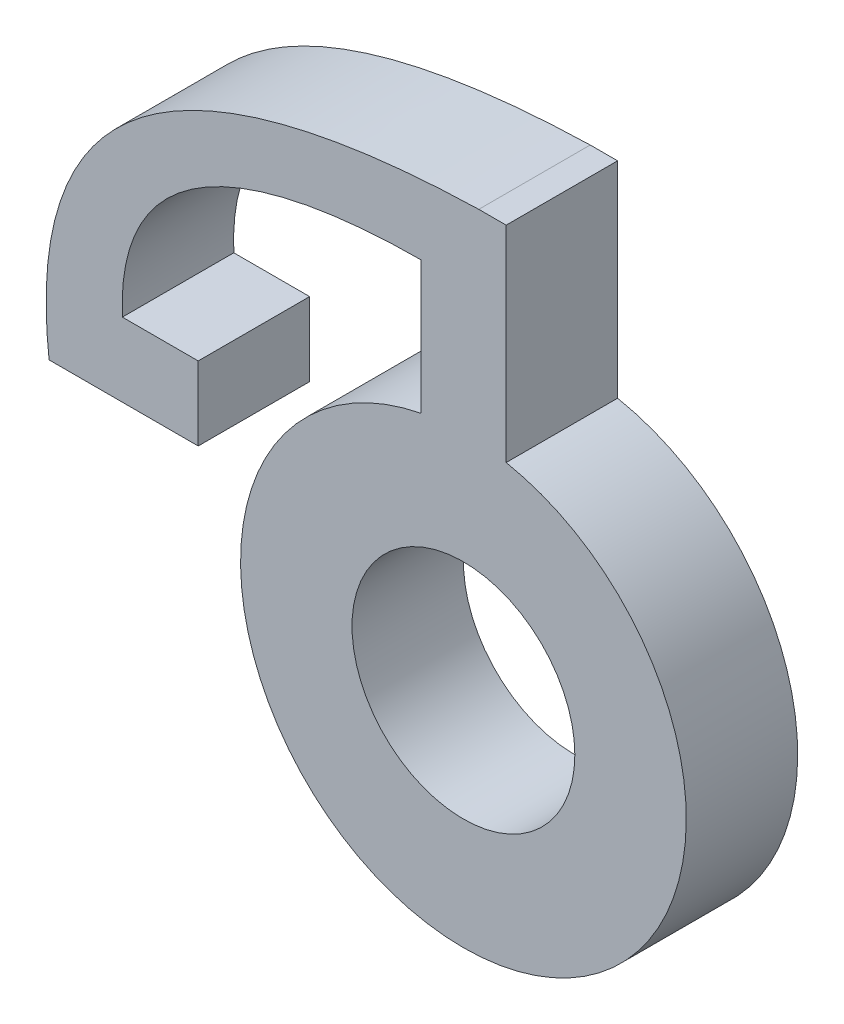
ISO-10303-21;
HEADER;
FILE_DESCRIPTION(('STEP AP214'),'2;1');
FILE_NAME('part.step','',(''),(''),'','','');
FILE_SCHEMA(('AUTOMOTIVE_DESIGN { 1 0 10303 214 1 1 1 1 }'));
ENDSEC;
DATA;
#1=APPLICATION_CONTEXT('core data for automotive mechanical design processes');
#2=APPLICATION_PROTOCOL_DEFINITION('international standard','automotive_design',2000,#1);
#3=PRODUCT_CONTEXT('',#1,'mechanical');
#4=PRODUCT('Part','Part','',(#3));
#5=PRODUCT_RELATED_PRODUCT_CATEGORY('part','',(#4));
#6=PRODUCT_DEFINITION_FORMATION('','',#4);
#7=PRODUCT_DEFINITION_CONTEXT('part definition',#1,'design');
#8=PRODUCT_DEFINITION('design','',#6,#7);
#9=PRODUCT_DEFINITION_SHAPE('','',#8);
#10=(LENGTH_UNIT() NAMED_UNIT(*) SI_UNIT(.MILLI.,.METRE.));
#11=(NAMED_UNIT(*) PLANE_ANGLE_UNIT() SI_UNIT($,.RADIAN.));
#12=(NAMED_UNIT(*) SI_UNIT($,.STERADIAN.) SOLID_ANGLE_UNIT());
#13=UNCERTAINTY_MEASURE_WITH_UNIT(LENGTH_MEASURE(1.E-05),#10,'distance_accuracy_value','');
#14=(GEOMETRIC_REPRESENTATION_CONTEXT(3) GLOBAL_UNCERTAINTY_ASSIGNED_CONTEXT((#13)) GLOBAL_UNIT_ASSIGNED_CONTEXT((#10,
#11,#12)) REPRESENTATION_CONTEXT('',''));
#15=CARTESIAN_POINT('',(0.,0.,0.));
#16=DIRECTION('',(0.,0.,1.));
#17=DIRECTION('',(1.,0.,0.));
#18=AXIS2_PLACEMENT_3D('',#15,#16,#17);
#19=CARTESIAN_POINT('',(0.,0.,3.175));
#20=DIRECTION('',(0.,0.,1.));
#21=DIRECTION('',(1.,0.,0.));
#22=AXIS2_PLACEMENT_3D('',#19,#20,#21);
#23=PLANE('',#22);
#24=CARTESIAN_POINT('',(0.,0.,3.175));
#25=DIRECTION('',(0.,0.,1.));
#26=DIRECTION('',(1.,0.,0.));
#27=AXIS2_PLACEMENT_3D('',#24,#25,#26);
#28=CIRCLE('',#27,6.35);
#29=CARTESIAN_POINT('',(-1.21254471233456,6.23315612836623,3.175));
#30=VERTEX_POINT('',#29);
#31=CARTESIAN_POINT('',(1.21809473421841,6.23207390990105,3.175));
#32=VERTEX_POINT('',#31);
#33=EDGE_CURVE('E228',#30,#32,#28,.T.);
#34=ORIENTED_EDGE('',*,*,#33,.T.);
#35=DIRECTION('',(0.,1.,0.));
#36=VECTOR('',#35,1.);
#37=CARTESIAN_POINT('',(1.21809473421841,12.0905218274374,3.175));
#38=LINE('',#37,#36);
#39=CARTESIAN_POINT('',(1.21809473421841,12.0905218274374,3.175));
#40=VERTEX_POINT('',#39);
#41=EDGE_CURVE('E96',#32,#40,#38,.T.);
#42=ORIENTED_EDGE('',*,*,#41,.T.);
#43=DIRECTION('',(-1.,0.,0.));
#44=VECTOR('',#43,1.);
#45=CARTESIAN_POINT('',(0.437924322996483,12.0905218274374,3.175));
#46=LINE('',#45,#44);
#47=CARTESIAN_POINT('',(0.437924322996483,12.0905218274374,3.175));
#48=VERTEX_POINT('',#47);
#49=EDGE_CURVE('E171',#40,#48,#46,.T.);
#50=ORIENTED_EDGE('',*,*,#49,.T.);
#51=CARTESIAN_POINT('',(0.437924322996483,12.0905218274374,3.175));
#52=CARTESIAN_POINT('',(-12.9098002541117,11.7386809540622,3.175));
#53=CARTESIAN_POINT('',(-11.8053695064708,2.25252211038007,3.175));
#54=B_SPLINE_CURVE_WITH_KNOTS('',2,(#51,#52,#53),.UNSPECIFIED.,.F.,.F.,(3,3),(0.,1.),.UNSPECIFIED.);
#55=CARTESIAN_POINT('',(-11.8053695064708,2.25252211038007,3.175));
#56=VERTEX_POINT('',#55);
#57=EDGE_CURVE('E164',#48,#56,#54,.T.);
#58=ORIENTED_EDGE('',*,*,#57,.T.);
#59=DIRECTION('',(1.,0.,0.));
#60=VECTOR('',#59,1.);
#61=CARTESIAN_POINT('',(-11.8053695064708,2.25252211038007,3.175));
#62=LINE('',#61,#60);
#63=CARTESIAN_POINT('',(-7.55702562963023,2.25252211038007,3.175));
#64=VERTEX_POINT('',#63);
#65=EDGE_CURVE('E170',#56,#64,#62,.T.);
#66=ORIENTED_EDGE('',*,*,#65,.T.);
#67=DIRECTION('',(0.,1.,0.));
#68=VECTOR('',#67,1.);
#69=CARTESIAN_POINT('',(-7.55702562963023,2.25252211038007,3.175));
#70=LINE('',#69,#68);
#71=CARTESIAN_POINT('',(-7.55702562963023,4.35238384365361,3.175));
#72=VERTEX_POINT('',#71);
#73=EDGE_CURVE('E118',#64,#72,#70,.T.);
#74=ORIENTED_EDGE('',*,*,#73,.T.);
#75=DIRECTION('',(-1.,0.,0.));
#76=VECTOR('',#75,1.);
#77=CARTESIAN_POINT('',(-7.55702562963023,4.35238384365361,3.175));
#78=LINE('',#77,#76);
#79=CARTESIAN_POINT('',(-9.71832555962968,4.35238384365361,3.175));
#80=VERTEX_POINT('',#79);
#81=EDGE_CURVE('E112',#72,#80,#78,.T.);
#82=ORIENTED_EDGE('',*,*,#81,.T.);
#83=CARTESIAN_POINT('',(-9.71832555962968,4.35238384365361,3.175));
#84=CARTESIAN_POINT('',(-9.92744832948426,9.2319151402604,3.175));
#85=CARTESIAN_POINT('',(-4.66054864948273,10.0073590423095,3.175));
#86=CARTESIAN_POINT('',(-1.21254471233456,10.0204833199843,3.175));
#87=B_SPLINE_CURVE_WITH_KNOTS('',3,(#83,#84,#85,#86),.UNSPECIFIED.,.F.,.F.,(4,4),(0.,
0.593316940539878),.UNSPECIFIED.);
#88=CARTESIAN_POINT('',(-1.21254471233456,10.0204833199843,3.175));
#89=VERTEX_POINT('',#88);
#90=EDGE_CURVE('E116',#80,#89,#87,.T.);
#91=ORIENTED_EDGE('',*,*,#90,.T.);
#92=DIRECTION('',(0.,-1.,0.));
#93=VECTOR('',#92,1.);
#94=CARTESIAN_POINT('',(-1.21254471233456,10.0204833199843,3.175));
#95=LINE('',#94,#93);
#96=EDGE_CURVE('E50',#89,#30,#95,.T.);
#97=ORIENTED_EDGE('',*,*,#96,.T.);
#98=EDGE_LOOP('',(#34,#42,#50,#58,#66,#74,#82,#91,#97));
#99=FACE_BOUND('',#98,.T.);
#100=CARTESIAN_POINT('',(0.,0.,3.175));
#101=DIRECTION('',(0.,0.,1.));
#102=DIRECTION('',(1.,0.,0.));
#103=AXIS2_PLACEMENT_3D('',#100,#101,#102);
#104=CIRCLE('',#103,3.175);
#105=CARTESIAN_POINT('',(3.175,0.,3.175));
#106=VERTEX_POINT('',#105);
#107=EDGE_CURVE('E232',#106,#106,#104,.T.);
#108=ORIENTED_EDGE('',*,*,#107,.F.);
#109=EDGE_LOOP('',(#108));
#110=FACE_BOUND('',#109,.T.);
#111=ADVANCED_FACE('F33',(#99,#110),#23,.T.);
#112=CARTESIAN_POINT('',(0.,0.,0.));
#113=DIRECTION('',(0.,0.,1.));
#114=DIRECTION('',(1.,0.,0.));
#115=AXIS2_PLACEMENT_3D('',#112,#113,#114);
#116=PLANE('',#115);
#117=CARTESIAN_POINT('',(0.,0.,0.));
#118=DIRECTION('',(0.,0.,1.));
#119=DIRECTION('',(1.,0.,0.));
#120=AXIS2_PLACEMENT_3D('',#117,#118,#119);
#121=CIRCLE('',#120,6.35);
#122=CARTESIAN_POINT('',(-1.21254471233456,6.23315612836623,0.));
#123=VERTEX_POINT('',#122);
#124=CARTESIAN_POINT('',(1.21809473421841,6.23207390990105,0.));
#125=VERTEX_POINT('',#124);
#126=EDGE_CURVE('E210',#123,#125,#121,.T.);
#127=ORIENTED_EDGE('',*,*,#126,.F.);
#128=DIRECTION('',(0.,-1.,0.));
#129=VECTOR('',#128,1.);
#130=CARTESIAN_POINT('',(-1.21254471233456,10.0204833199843,0.));
#131=LINE('',#130,#129);
#132=CARTESIAN_POINT('',(-1.21254471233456,10.0204833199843,0.));
#133=VERTEX_POINT('',#132);
#134=EDGE_CURVE('E88',#133,#123,#131,.T.);
#135=ORIENTED_EDGE('',*,*,#134,.F.);
#136=CARTESIAN_POINT('',(-9.71832555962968,4.35238384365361,0.));
#137=CARTESIAN_POINT('',(-9.92744832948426,9.2319151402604,0.));
#138=CARTESIAN_POINT('',(-4.66054864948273,10.0073590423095,0.));
#139=CARTESIAN_POINT('',(-1.21254471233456,10.0204833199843,0.));
#140=B_SPLINE_CURVE_WITH_KNOTS('',3,(#136,#137,#138,#139),.UNSPECIFIED.,.F.,.F.,(4,4),(0.,
0.593316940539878),.UNSPECIFIED.);
#141=CARTESIAN_POINT('',(-9.71832555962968,4.35238384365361,0.));
#142=VERTEX_POINT('',#141);
#143=EDGE_CURVE('E82',#142,#133,#140,.T.);
#144=ORIENTED_EDGE('',*,*,#143,.F.);
#145=DIRECTION('',(-1.,0.,0.));
#146=VECTOR('',#145,1.);
#147=CARTESIAN_POINT('',(-7.55702562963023,4.35238384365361,0.));
#148=LINE('',#147,#146);
#149=CARTESIAN_POINT('',(-7.55702562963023,4.35238384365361,0.));
#150=VERTEX_POINT('',#149);
#151=EDGE_CURVE('E126',#150,#142,#148,.T.);
#152=ORIENTED_EDGE('',*,*,#151,.F.);
#153=DIRECTION('',(0.,1.,0.));
#154=VECTOR('',#153,1.);
#155=CARTESIAN_POINT('',(-7.55702562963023,2.25252211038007,0.));
#156=LINE('',#155,#154);
#157=CARTESIAN_POINT('',(-7.55702562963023,2.25252211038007,0.));
#158=VERTEX_POINT('',#157);
#159=EDGE_CURVE('E188',#158,#150,#156,.T.);
#160=ORIENTED_EDGE('',*,*,#159,.F.);
#161=DIRECTION('',(1.,0.,0.));
#162=VECTOR('',#161,1.);
#163=CARTESIAN_POINT('',(-11.8053695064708,2.25252211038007,0.));
#164=LINE('',#163,#162);
#165=CARTESIAN_POINT('',(-11.8053695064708,2.25252211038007,0.));
#166=VERTEX_POINT('',#165);
#167=EDGE_CURVE('E184',#166,#158,#164,.T.);
#168=ORIENTED_EDGE('',*,*,#167,.F.);
#169=CARTESIAN_POINT('',(0.437924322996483,12.0905218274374,0.));
#170=CARTESIAN_POINT('',(-12.9098002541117,11.7386809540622,0.));
#171=CARTESIAN_POINT('',(-11.8053695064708,2.25252211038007,0.));
#172=B_SPLINE_CURVE_WITH_KNOTS('',2,(#169,#170,#171),.UNSPECIFIED.,.F.,.F.,(3,3),(0.,1.),.UNSPECIFIED.);
#173=CARTESIAN_POINT('',(0.437924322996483,12.0905218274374,0.));
#174=VERTEX_POINT('',#173);
#175=EDGE_CURVE('E207',#174,#166,#172,.T.);
#176=ORIENTED_EDGE('',*,*,#175,.F.);
#177=DIRECTION('',(-1.,0.,0.));
#178=VECTOR('',#177,1.);
#179=CARTESIAN_POINT('',(0.437924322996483,12.0905218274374,0.));
#180=LINE('',#179,#178);
#181=CARTESIAN_POINT('',(1.21809473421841,12.0905218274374,0.));
#182=VERTEX_POINT('',#181);
#183=EDGE_CURVE('E200',#182,#174,#180,.T.);
#184=ORIENTED_EDGE('',*,*,#183,.F.);
#185=DIRECTION('',(0.,1.,0.));
#186=VECTOR('',#185,1.);
#187=CARTESIAN_POINT('',(1.21809473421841,12.0905218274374,0.));
#188=LINE('',#187,#186);
#189=EDGE_CURVE('E206',#125,#182,#188,.T.);
#190=ORIENTED_EDGE('',*,*,#189,.F.);
#191=EDGE_LOOP('',(#127,#135,#144,#152,#160,#168,#176,#184,#190));
#192=FACE_BOUND('',#191,.T.);
#193=CARTESIAN_POINT('',(0.,0.,0.));
#194=DIRECTION('',(0.,0.,1.));
#195=DIRECTION('',(1.,0.,0.));
#196=AXIS2_PLACEMENT_3D('',#193,#194,#195);
#197=CIRCLE('',#196,3.175);
#198=CARTESIAN_POINT('',(3.175,0.,0.));
#199=VERTEX_POINT('',#198);
#200=EDGE_CURVE('E234',#199,#199,#197,.T.);
#201=ORIENTED_EDGE('',*,*,#200,.T.);
#202=EDGE_LOOP('',(#201));
#203=FACE_BOUND('',#202,.T.);
#204=ADVANCED_FACE('F204',(#192,#203),#116,.F.);
#205=CARTESIAN_POINT('',(0.,0.,3.175));
#206=DIRECTION('',(0.,0.,-1.));
#207=DIRECTION('',(-1.,0.,0.));
#208=AXIS2_PLACEMENT_3D('',#205,#206,#207);
#209=CYLINDRICAL_SURFACE('',#208,6.35);
#210=ORIENTED_EDGE('',*,*,#126,.T.);
#211=DIRECTION('',(0.,0.,-1.));
#212=VECTOR('',#211,1.);
#213=CARTESIAN_POINT('',(1.21809473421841,6.23207390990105,3.175));
#214=LINE('',#213,#212);
#215=EDGE_CURVE('E11',#32,#125,#214,.T.);
#216=ORIENTED_EDGE('',*,*,#215,.F.);
#217=ORIENTED_EDGE('',*,*,#33,.F.);
#218=DIRECTION('',(0.,0.,-1.));
#219=VECTOR('',#218,1.);
#220=CARTESIAN_POINT('',(-1.21254471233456,6.23315612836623,3.175));
#221=LINE('',#220,#219);
#222=EDGE_CURVE('E132',#30,#123,#221,.T.);
#223=ORIENTED_EDGE('',*,*,#222,.T.);
#224=EDGE_LOOP('',(#210,#216,#217,#223));
#225=FACE_BOUND('',#224,.T.);
#226=ADVANCED_FACE('F35',(#225),#209,.T.);
#227=CARTESIAN_POINT('',(1.21809473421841,12.0905218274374,3.175));
#228=DIRECTION('',(-1.,0.,0.));
#229=DIRECTION('',(0.,-1.,0.));
#230=AXIS2_PLACEMENT_3D('',#227,#228,#229);
#231=PLANE('',#230);
#232=ORIENTED_EDGE('',*,*,#189,.T.);
#233=DIRECTION('',(0.,0.,-1.));
#234=VECTOR('',#233,1.);
#235=CARTESIAN_POINT('',(1.21809473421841,12.0905218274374,3.175));
#236=LINE('',#235,#234);
#237=EDGE_CURVE('E42',#40,#182,#236,.T.);
#238=ORIENTED_EDGE('',*,*,#237,.F.);
#239=ORIENTED_EDGE('',*,*,#41,.F.);
#240=ORIENTED_EDGE('',*,*,#215,.T.);
#241=EDGE_LOOP('',(#232,#238,#239,#240));
#242=FACE_BOUND('',#241,.T.);
#243=ADVANCED_FACE('F242',(#242),#231,.F.);
#244=CARTESIAN_POINT('',(0.437924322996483,12.0905218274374,3.175));
#245=DIRECTION('',(0.,-1.,0.));
#246=DIRECTION('',(0.,0.,-1.));
#247=AXIS2_PLACEMENT_3D('',#244,#245,#246);
#248=PLANE('',#247);
#249=ORIENTED_EDGE('',*,*,#183,.T.);
#250=DIRECTION('',(0.,0.,-1.));
#251=VECTOR('',#250,1.);
#252=CARTESIAN_POINT('',(0.437924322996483,12.0905218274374,3.175));
#253=LINE('',#252,#251);
#254=EDGE_CURVE('E193',#48,#174,#253,.T.);
#255=ORIENTED_EDGE('',*,*,#254,.F.);
#256=ORIENTED_EDGE('',*,*,#49,.F.);
#257=ORIENTED_EDGE('',*,*,#237,.T.);
#258=EDGE_LOOP('',(#249,#255,#256,#257));
#259=FACE_BOUND('',#258,.T.);
#260=ADVANCED_FACE('F162',(#259),#248,.F.);
#261=DIRECTION('',(0.,0.,-1.));
#262=VECTOR('',#261,1.);
#263=SURFACE_OF_LINEAR_EXTRUSION('',#54,#262);
#264=ORIENTED_EDGE('',*,*,#175,.T.);
#265=DIRECTION('',(0.,0.,-1.));
#266=VECTOR('',#265,1.);
#267=CARTESIAN_POINT('',(-11.8053695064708,2.25252211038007,3.175));
#268=LINE('',#267,#266);
#269=EDGE_CURVE('E186',#56,#166,#268,.T.);
#270=ORIENTED_EDGE('',*,*,#269,.F.);
#271=ORIENTED_EDGE('',*,*,#57,.F.);
#272=ORIENTED_EDGE('',*,*,#254,.T.);
#273=EDGE_LOOP('',(#264,#270,#271,#272));
#274=FACE_BOUND('',#273,.T.);
#275=ADVANCED_FACE('F157',(#274),#263,.F.);
#276=CARTESIAN_POINT('',(-11.8053695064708,2.25252211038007,3.175));
#277=DIRECTION('',(0.,1.,0.));
#278=DIRECTION('',(0.,0.,1.));
#279=AXIS2_PLACEMENT_3D('',#276,#277,#278);
#280=PLANE('',#279);
#281=ORIENTED_EDGE('',*,*,#167,.T.);
#282=DIRECTION('',(0.,0.,-1.));
#283=VECTOR('',#282,1.);
#284=CARTESIAN_POINT('',(-7.55702562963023,2.25252211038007,3.175));
#285=LINE('',#284,#283);
#286=EDGE_CURVE('E182',#64,#158,#285,.T.);
#287=ORIENTED_EDGE('',*,*,#286,.F.);
#288=ORIENTED_EDGE('',*,*,#65,.F.);
#289=ORIENTED_EDGE('',*,*,#269,.T.);
#290=EDGE_LOOP('',(#281,#287,#288,#289));
#291=FACE_BOUND('',#290,.T.);
#292=ADVANCED_FACE('F153',(#291),#280,.F.);
#293=CARTESIAN_POINT('',(-7.55702562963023,2.25252211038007,3.175));
#294=DIRECTION('',(-1.,0.,0.));
#295=DIRECTION('',(0.,0.,1.));
#296=AXIS2_PLACEMENT_3D('',#293,#294,#295);
#297=PLANE('',#296);
#298=ORIENTED_EDGE('',*,*,#159,.T.);
#299=DIRECTION('',(0.,0.,-1.));
#300=VECTOR('',#299,1.);
#301=CARTESIAN_POINT('',(-7.55702562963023,4.35238384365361,3.175));
#302=LINE('',#301,#300);
#303=EDGE_CURVE('E127',#72,#150,#302,.T.);
#304=ORIENTED_EDGE('',*,*,#303,.F.);
#305=ORIENTED_EDGE('',*,*,#73,.F.);
#306=ORIENTED_EDGE('',*,*,#286,.T.);
#307=EDGE_LOOP('',(#298,#304,#305,#306));
#308=FACE_BOUND('',#307,.T.);
#309=ADVANCED_FACE('F150',(#308),#297,.F.);
#310=CARTESIAN_POINT('',(-7.55702562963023,4.35238384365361,3.175));
#311=DIRECTION('',(0.,-1.,0.));
#312=DIRECTION('',(1.,0.,0.));
#313=AXIS2_PLACEMENT_3D('',#310,#311,#312);
#314=PLANE('',#313);
#315=ORIENTED_EDGE('',*,*,#151,.T.);
#316=DIRECTION('',(0.,0.,-1.));
#317=VECTOR('',#316,1.);
#318=CARTESIAN_POINT('',(-9.71832555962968,4.35238384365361,3.175));
#319=LINE('',#318,#317);
#320=EDGE_CURVE('E123',#80,#142,#319,.T.);
#321=ORIENTED_EDGE('',*,*,#320,.F.);
#322=ORIENTED_EDGE('',*,*,#81,.F.);
#323=ORIENTED_EDGE('',*,*,#303,.T.);
#324=EDGE_LOOP('',(#315,#321,#322,#323));
#325=FACE_BOUND('',#324,.T.);
#326=ADVANCED_FACE('F124',(#325),#314,.F.);
#327=DIRECTION('',(0.,0.,-1.));
#328=VECTOR('',#327,1.);
#329=SURFACE_OF_LINEAR_EXTRUSION('',#87,#328);
#330=ORIENTED_EDGE('',*,*,#143,.T.);
#331=DIRECTION('',(0.,0.,-1.));
#332=VECTOR('',#331,1.);
#333=CARTESIAN_POINT('',(-1.21254471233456,10.0204833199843,3.175));
#334=LINE('',#333,#332);
#335=EDGE_CURVE('E128',#89,#133,#334,.T.);
#336=ORIENTED_EDGE('',*,*,#335,.F.);
#337=ORIENTED_EDGE('',*,*,#90,.F.);
#338=ORIENTED_EDGE('',*,*,#320,.T.);
#339=EDGE_LOOP('',(#330,#336,#337,#338));
#340=FACE_BOUND('',#339,.T.);
#341=ADVANCED_FACE('F130',(#340),#329,.F.);
#342=CARTESIAN_POINT('',(-1.21254471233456,10.0204833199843,3.175));
#343=DIRECTION('',(1.,0.,0.));
#344=DIRECTION('',(0.,1.,0.));
#345=AXIS2_PLACEMENT_3D('',#342,#343,#344);
#346=PLANE('',#345);
#347=ORIENTED_EDGE('',*,*,#134,.T.);
#348=ORIENTED_EDGE('',*,*,#222,.F.);
#349=ORIENTED_EDGE('',*,*,#96,.F.);
#350=ORIENTED_EDGE('',*,*,#335,.T.);
#351=EDGE_LOOP('',(#347,#348,#349,#350));
#352=FACE_BOUND('',#351,.T.);
#353=ADVANCED_FACE('F146',(#352),#346,.F.);
#354=CARTESIAN_POINT('',(0.,0.,3.175));
#355=DIRECTION('',(0.,0.,-1.));
#356=DIRECTION('',(-1.,0.,0.));
#357=AXIS2_PLACEMENT_3D('',#354,#355,#356);
#358=CYLINDRICAL_SURFACE('',#357,3.175);
#359=ORIENTED_EDGE('',*,*,#107,.T.);
#360=EDGE_LOOP('',(#359));
#361=FACE_BOUND('',#360,.T.);
#362=ORIENTED_EDGE('',*,*,#200,.F.);
#363=EDGE_LOOP('',(#362));
#364=FACE_BOUND('',#363,.T.);
#365=ADVANCED_FACE('F254',(#361,#364),#358,.F.);
#366=CLOSED_SHELL('',(#111,#204,#226,#243,#260,#275,#292,#309,#326,#341,#353,#365));
#367=MANIFOLD_SOLID_BREP('B2',#366);
#368=ADVANCED_BREP_SHAPE_REPRESENTATION('',(#18,#367),#14);
#369=SHAPE_DEFINITION_REPRESENTATION(#9,#368);
ENDSEC;
END-ISO-10303-21;
